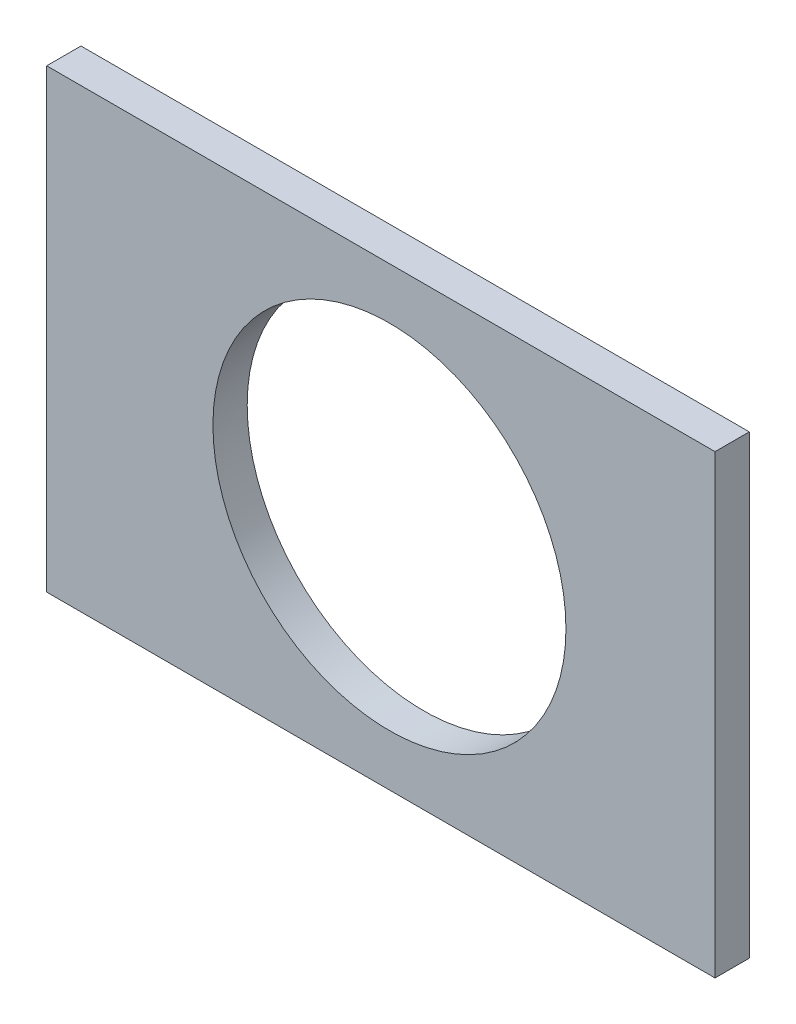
ISO-10303-21;
HEADER;
FILE_DESCRIPTION(('STEP AP214'),'2;1');
FILE_NAME('part.step','',(''),(''),'','','');
FILE_SCHEMA(('AUTOMOTIVE_DESIGN { 1 0 10303 214 1 1 1 1 }'));
ENDSEC;
DATA;
#1=APPLICATION_CONTEXT('core data for automotive mechanical design processes');
#2=APPLICATION_PROTOCOL_DEFINITION('international standard','automotive_design',2000,#1);
#3=PRODUCT_CONTEXT('',#1,'mechanical');
#4=PRODUCT('Part','Part','',(#3));
#5=PRODUCT_RELATED_PRODUCT_CATEGORY('part','',(#4));
#6=PRODUCT_DEFINITION_FORMATION('','',#4);
#7=PRODUCT_DEFINITION_CONTEXT('part definition',#1,'design');
#8=PRODUCT_DEFINITION('design','',#6,#7);
#9=PRODUCT_DEFINITION_SHAPE('','',#8);
#10=(LENGTH_UNIT() NAMED_UNIT(*) SI_UNIT(.MILLI.,.METRE.));
#11=(NAMED_UNIT(*) PLANE_ANGLE_UNIT() SI_UNIT($,.RADIAN.));
#12=(NAMED_UNIT(*) SI_UNIT($,.STERADIAN.) SOLID_ANGLE_UNIT());
#13=UNCERTAINTY_MEASURE_WITH_UNIT(LENGTH_MEASURE(1.E-05),#10,'distance_accuracy_value','');
#14=(GEOMETRIC_REPRESENTATION_CONTEXT(3) GLOBAL_UNCERTAINTY_ASSIGNED_CONTEXT((#13)) GLOBAL_UNIT_ASSIGNED_CONTEXT((#10,
#11,#12)) REPRESENTATION_CONTEXT('',''));
#15=CARTESIAN_POINT('',(0.,0.,0.));
#16=DIRECTION('',(0.,0.,1.));
#17=DIRECTION('',(1.,0.,0.));
#18=AXIS2_PLACEMENT_3D('',#15,#16,#17);
#19=CARTESIAN_POINT('',(0.,0.,10.));
#20=DIRECTION('',(1.,0.,0.));
#21=DIRECTION('',(0.,0.,-1.));
#22=AXIS2_PLACEMENT_3D('',#19,#20,#21);
#23=PLANE('',#22);
#24=DIRECTION('',(0.,-1.,0.));
#25=VECTOR('',#24,1.);
#26=CARTESIAN_POINT('',(0.,0.,0.));
#27=LINE('',#26,#25);
#28=CARTESIAN_POINT('',(0.,133.,0.));
#29=VERTEX_POINT('',#28);
#30=CARTESIAN_POINT('',(0.,0.,0.));
#31=VERTEX_POINT('',#30);
#32=EDGE_CURVE('E95',#29,#31,#27,.T.);
#33=ORIENTED_EDGE('',*,*,#32,.T.);
#34=DIRECTION('',(0.,0.,-1.));
#35=VECTOR('',#34,1.);
#36=CARTESIAN_POINT('',(0.,0.,10.));
#37=LINE('',#36,#35);
#38=CARTESIAN_POINT('',(0.,0.,10.));
#39=VERTEX_POINT('',#38);
#40=EDGE_CURVE('E11',#39,#31,#37,.T.);
#41=ORIENTED_EDGE('',*,*,#40,.F.);
#42=DIRECTION('',(0.,-1.,0.));
#43=VECTOR('',#42,1.);
#44=CARTESIAN_POINT('',(0.,0.,10.));
#45=LINE('',#44,#43);
#46=CARTESIAN_POINT('',(0.,133.,10.));
#47=VERTEX_POINT('',#46);
#48=EDGE_CURVE('E83',#47,#39,#45,.T.);
#49=ORIENTED_EDGE('',*,*,#48,.F.);
#50=DIRECTION('',(0.,0.,-1.));
#51=VECTOR('',#50,1.);
#52=CARTESIAN_POINT('',(0.,133.,10.));
#53=LINE('',#52,#51);
#54=EDGE_CURVE('E91',#47,#29,#53,.T.);
#55=ORIENTED_EDGE('',*,*,#54,.T.);
#56=EDGE_LOOP('',(#33,#41,#49,#55));
#57=FACE_BOUND('',#56,.T.);
#58=ADVANCED_FACE('F32',(#57),#23,.F.);
#59=CARTESIAN_POINT('',(0.,0.,10.));
#60=DIRECTION('',(0.,1.,0.));
#61=DIRECTION('',(0.,0.,1.));
#62=AXIS2_PLACEMENT_3D('',#59,#60,#61);
#63=PLANE('',#62);
#64=DIRECTION('',(1.,0.,0.));
#65=VECTOR('',#64,1.);
#66=CARTESIAN_POINT('',(0.,0.,0.));
#67=LINE('',#66,#65);
#68=CARTESIAN_POINT('',(195.,0.,0.));
#69=VERTEX_POINT('',#68);
#70=EDGE_CURVE('E87',#31,#69,#67,.T.);
#71=ORIENTED_EDGE('',*,*,#70,.T.);
#72=DIRECTION('',(0.,0.,-1.));
#73=VECTOR('',#72,1.);
#74=CARTESIAN_POINT('',(195.,0.,10.));
#75=LINE('',#74,#73);
#76=CARTESIAN_POINT('',(195.,0.,10.));
#77=VERTEX_POINT('',#76);
#78=EDGE_CURVE('E40',#77,#69,#75,.T.);
#79=ORIENTED_EDGE('',*,*,#78,.F.);
#80=DIRECTION('',(1.,0.,0.));
#81=VECTOR('',#80,1.);
#82=CARTESIAN_POINT('',(0.,0.,10.));
#83=LINE('',#82,#81);
#84=EDGE_CURVE('E78',#39,#77,#83,.T.);
#85=ORIENTED_EDGE('',*,*,#84,.F.);
#86=ORIENTED_EDGE('',*,*,#40,.T.);
#87=EDGE_LOOP('',(#71,#79,#85,#86));
#88=FACE_BOUND('',#87,.T.);
#89=ADVANCED_FACE('F86',(#88),#63,.F.);
#90=CARTESIAN_POINT('',(195.,0.,10.));
#91=DIRECTION('',(-1.,0.,0.));
#92=DIRECTION('',(0.,0.,1.));
#93=AXIS2_PLACEMENT_3D('',#90,#91,#92);
#94=PLANE('',#93);
#95=DIRECTION('',(0.,1.,0.));
#96=VECTOR('',#95,1.);
#97=CARTESIAN_POINT('',(195.,0.,0.));
#98=LINE('',#97,#96);
#99=CARTESIAN_POINT('',(195.,133.,0.));
#100=VERTEX_POINT('',#99);
#101=EDGE_CURVE('E65',#69,#100,#98,.T.);
#102=ORIENTED_EDGE('',*,*,#101,.T.);
#103=DIRECTION('',(0.,0.,-1.));
#104=VECTOR('',#103,1.);
#105=CARTESIAN_POINT('',(195.,133.,10.));
#106=LINE('',#105,#104);
#107=CARTESIAN_POINT('',(195.,133.,10.));
#108=VERTEX_POINT('',#107);
#109=EDGE_CURVE('E88',#108,#100,#106,.T.);
#110=ORIENTED_EDGE('',*,*,#109,.F.);
#111=DIRECTION('',(0.,1.,0.));
#112=VECTOR('',#111,1.);
#113=CARTESIAN_POINT('',(195.,0.,10.));
#114=LINE('',#113,#112);
#115=EDGE_CURVE('E81',#77,#108,#114,.T.);
#116=ORIENTED_EDGE('',*,*,#115,.F.);
#117=ORIENTED_EDGE('',*,*,#78,.T.);
#118=EDGE_LOOP('',(#102,#110,#116,#117));
#119=FACE_BOUND('',#118,.T.);
#120=ADVANCED_FACE('F89',(#119),#94,.F.);
#121=CARTESIAN_POINT('',(0.,133.,10.));
#122=DIRECTION('',(0.,-1.,0.));
#123=DIRECTION('',(0.,0.,-1.));
#124=AXIS2_PLACEMENT_3D('',#121,#122,#123);
#125=PLANE('',#124);
#126=DIRECTION('',(-1.,0.,0.));
#127=VECTOR('',#126,1.);
#128=CARTESIAN_POINT('',(0.,133.,0.));
#129=LINE('',#128,#127);
#130=EDGE_CURVE('E71',#100,#29,#129,.T.);
#131=ORIENTED_EDGE('',*,*,#130,.T.);
#132=ORIENTED_EDGE('',*,*,#54,.F.);
#133=DIRECTION('',(-1.,0.,0.));
#134=VECTOR('',#133,1.);
#135=CARTESIAN_POINT('',(0.,133.,10.));
#136=LINE('',#135,#134);
#137=EDGE_CURVE('E48',#108,#47,#136,.T.);
#138=ORIENTED_EDGE('',*,*,#137,.F.);
#139=ORIENTED_EDGE('',*,*,#109,.T.);
#140=EDGE_LOOP('',(#131,#132,#138,#139));
#141=FACE_BOUND('',#140,.T.);
#142=ADVANCED_FACE('F103',(#141),#125,.F.);
#143=CARTESIAN_POINT('',(0.,133.,10.));
#144=DIRECTION('',(0.,0.,-1.));
#145=DIRECTION('',(-1.,0.,0.));
#146=AXIS2_PLACEMENT_3D('',#143,#144,#145);
#147=PLANE('',#146);
#148=CARTESIAN_POINT('',(100.,66.5,10.));
#149=DIRECTION('',(0.,0.,1.));
#150=DIRECTION('',(1.,0.,0.));
#151=AXIS2_PLACEMENT_3D('',#148,#149,#150);
#152=CIRCLE('',#151,51.5);
#153=CARTESIAN_POINT('',(151.5,66.5,10.));
#154=VERTEX_POINT('',#153);
#155=EDGE_CURVE('E98',#154,#154,#152,.T.);
#156=ORIENTED_EDGE('',*,*,#155,.F.);
#157=EDGE_LOOP('',(#156));
#158=FACE_BOUND('',#157,.T.);
#159=ORIENTED_EDGE('',*,*,#48,.T.);
#160=ORIENTED_EDGE('',*,*,#84,.T.);
#161=ORIENTED_EDGE('',*,*,#115,.T.);
#162=ORIENTED_EDGE('',*,*,#137,.T.);
#163=EDGE_LOOP('',(#159,#160,#161,#162));
#164=FACE_BOUND('',#163,.T.);
#165=ADVANCED_FACE('F79',(#158,#164),#147,.F.);
#166=CARTESIAN_POINT('',(0.,133.,0.));
#167=DIRECTION('',(0.,0.,-1.));
#168=DIRECTION('',(-1.,0.,0.));
#169=AXIS2_PLACEMENT_3D('',#166,#167,#168);
#170=PLANE('',#169);
#171=CARTESIAN_POINT('',(100.,66.5,0.));
#172=DIRECTION('',(0.,0.,-1.));
#173=DIRECTION('',(-1.,0.,0.));
#174=AXIS2_PLACEMENT_3D('',#171,#172,#173);
#175=CIRCLE('',#174,51.5);
#176=CARTESIAN_POINT('',(48.5,66.5,0.));
#177=VERTEX_POINT('',#176);
#178=EDGE_CURVE('E109',#177,#177,#175,.F.);
#179=ORIENTED_EDGE('',*,*,#178,.T.);
#180=EDGE_LOOP('',(#179));
#181=FACE_BOUND('',#180,.T.);
#182=ORIENTED_EDGE('',*,*,#32,.F.);
#183=ORIENTED_EDGE('',*,*,#130,.F.);
#184=ORIENTED_EDGE('',*,*,#101,.F.);
#185=ORIENTED_EDGE('',*,*,#70,.F.);
#186=EDGE_LOOP('',(#182,#183,#184,#185));
#187=FACE_BOUND('',#186,.T.);
#188=ADVANCED_FACE('F106',(#181,#187),#170,.T.);
#189=CARTESIAN_POINT('',(100.,66.5,-0.000999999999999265));
#190=DIRECTION('',(0.,0.,1.));
#191=DIRECTION('',(1.,0.,0.));
#192=AXIS2_PLACEMENT_3D('',#189,#190,#191);
#193=CYLINDRICAL_SURFACE('',#192,51.5);
#194=ORIENTED_EDGE('',*,*,#178,.F.);
#195=EDGE_LOOP('',(#194));
#196=FACE_BOUND('',#195,.T.);
#197=ORIENTED_EDGE('',*,*,#155,.T.);
#198=EDGE_LOOP('',(#197));
#199=FACE_BOUND('',#198,.T.);
#200=ADVANCED_FACE('F115',(#196,#199),#193,.F.);
#201=CLOSED_SHELL('',(#58,#89,#120,#142,#165,#188,#200));
#202=MANIFOLD_SOLID_BREP('B2',#201);
#203=ADVANCED_BREP_SHAPE_REPRESENTATION('',(#18,#202),#14);
#204=SHAPE_DEFINITION_REPRESENTATION(#9,#203);
ENDSEC;
END-ISO-10303-21;
